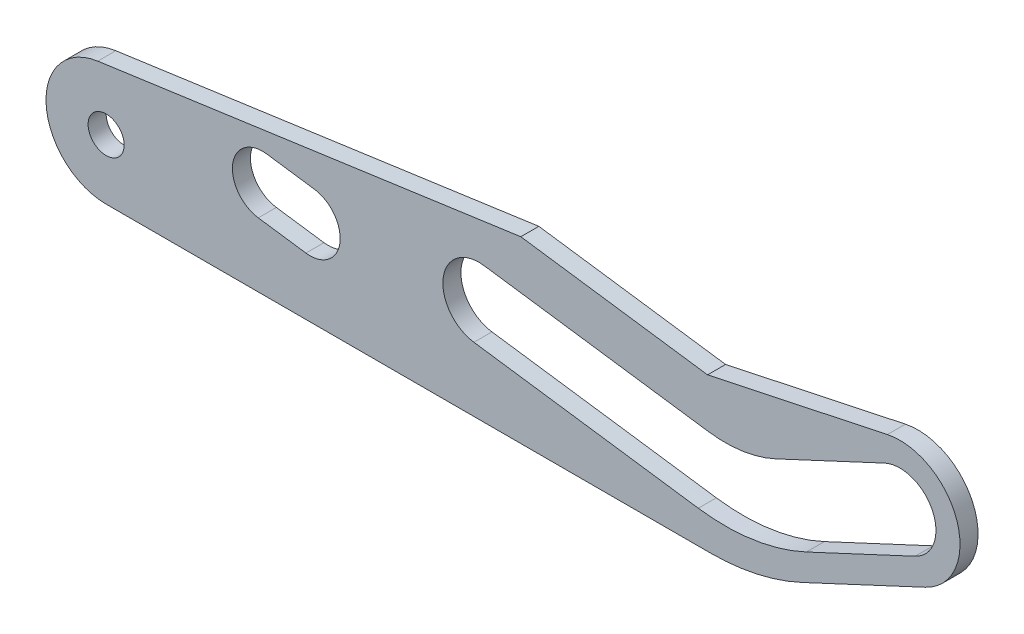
from build123d import *

# Parameters (mm, degrees)
BASE_EXTRUSION_DEPTH      = 0.75
BASE_EXTRUSION_DEPTH_BACK = 0.75
ESQUISSE1_R               = 1.5


with BuildPart() as part:
    # Esquisse1 → Base-Extrusion (new, two sides: drawn at the far end of the back side and taken through both)
    with BuildSketch(Plane.XY.offset(-BASE_EXTRUSION_DEPTH_BACK)):
        with BuildLine():
            Line((-0.695865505, 4.951340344), (34.480829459, 9.895102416))
            Line((34.480829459, 9.895102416), (50.00913982, 7.712740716))
            Line((50.00913982, 7.712740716), (64.960441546, 10.890738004))
            ThreePointArc((64.960441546, 10.890738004), (70.741618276, 7.586523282), (68.113091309, 1.468461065))
            Line((68.113091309, 1.468461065), (57.858056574, -3.313540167))
            ThreePointArc((57.858056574, -3.313540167), (54.146840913, -4.573328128), (50.250927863, -5))
            Line((50.250927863, -5), (0, -5))
            ThreePointArc((0, -5), (-4.987820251, -0.348782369), (-0.695865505, 4.951340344))
        make_face()
        Circle(ESQUISSE1_R, mode=Mode.SUBTRACT)
        with BuildLine():
            Line((64.732145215, 8.718923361), (55.692776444, 4.503796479))
            ThreePointArc((55.692776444, 4.503796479), (52.944687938, 3.676715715), (50.074862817, 3.664193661))
            Line((50.074862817, 3.664193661), (31.417519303, 6.286312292))
            ThreePointArc((31.417519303, 6.286312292), (28.029195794, 3.733027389), (30.582480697, 0.34470388))
            Line((30.582480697, 0.34470388), (49.239824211, -2.277414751))
            ThreePointArc((49.239824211, -2.277414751), (53.831544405, -2.257379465), (58.228486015, -0.934050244))
            Line((58.228486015, -0.934050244), (67.267854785, 3.281076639))
            ThreePointArc((67.267854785, 3.281076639), (68.718923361, 7.267854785), (64.732145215, 8.718923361))
        make_face(mode=Mode.SUBTRACT)
        with BuildLine():
            Line((17.309005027, 4.734738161), (13.347932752, 5.291430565))
            ThreePointArc((13.347932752, 5.291430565), (10.524329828, 3.163693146), (12.652067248, 0.340090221))
            Line((12.652067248, 0.340090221), (16.613139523, -0.216602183))
            ThreePointArc((16.613139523, -0.216602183), (19.436742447, 1.911135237), (17.309005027, 4.734738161))
        make_face(mode=Mode.SUBTRACT)
    extrude(amount=BASE_EXTRUSION_DEPTH + BASE_EXTRUSION_DEPTH_BACK)


solid = part.part
